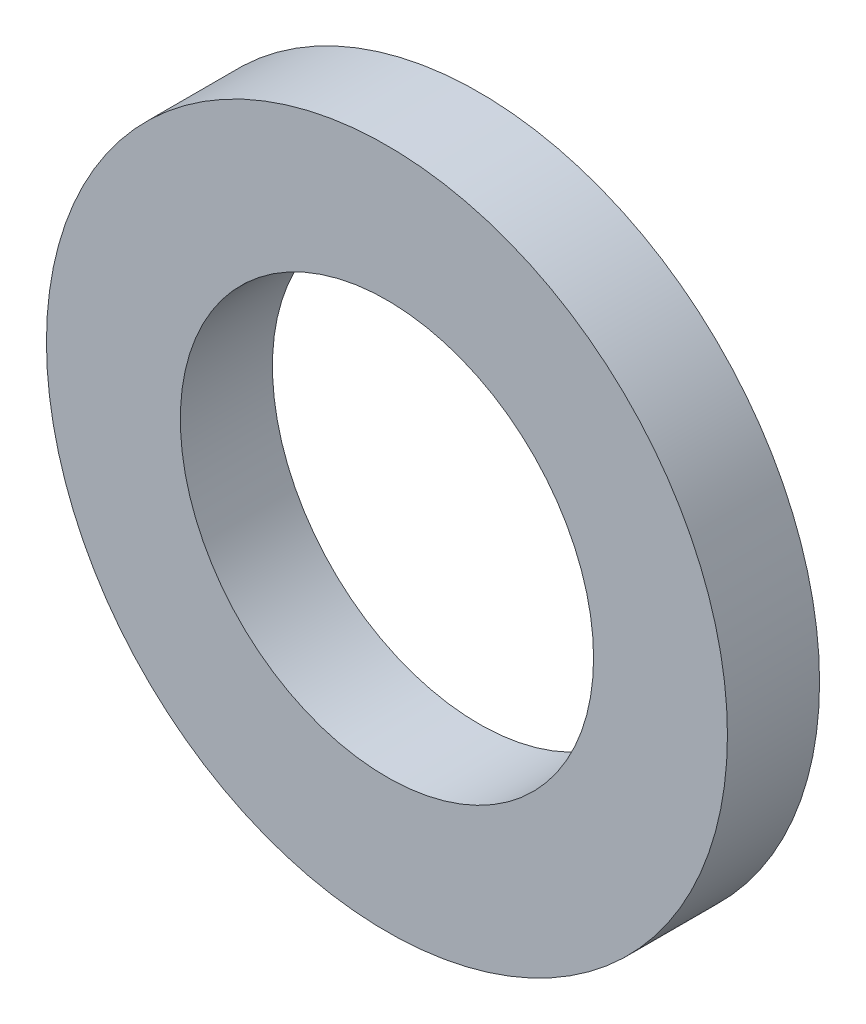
from build123d import *

# Parameters (mm, degrees)
SKETCH1_R          = 5.545
SKETCH1_R_2        = 3.365
BASE_EXTRUDE_DEPTH = 1.5


with BuildPart() as part:
    # Sketch1 → Base-Extrude (new body)
    with BuildSketch(Plane.XY):
        Circle(SKETCH1_R)
        Circle(SKETCH1_R_2, mode=Mode.SUBTRACT)
    extrude(amount=BASE_EXTRUDE_DEPTH)


solid = part.part
